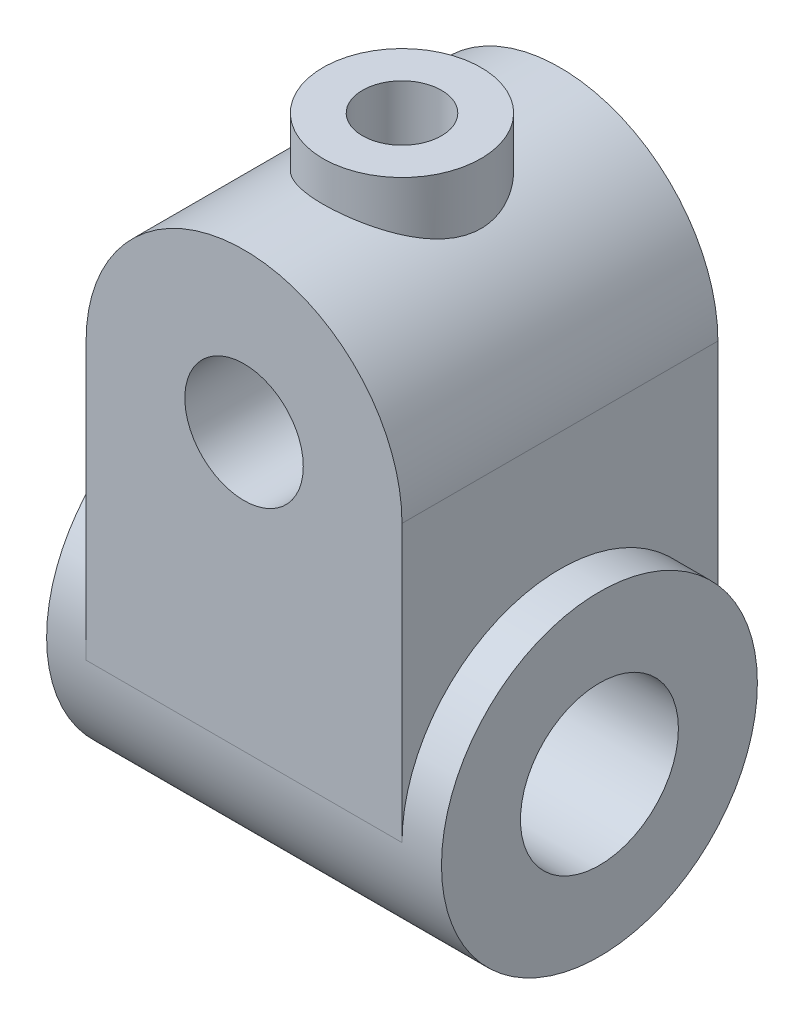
from build123d import *

# Parameters (mm, degrees)
SKETCH_1_R               = 15
EXTRUDE_1_DEPTH          = 40
EXTRUDE_2_DEPTH          = 10
EXTRUDE_2_DEPTH_BACK     = 90
SKETCH_2_R               = 40
SKETCH_3_R               = 20
CUT_EXTRUDE_1_DEPTH      = 154.948043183
EXTRUDE_3_REACH          = 189.883
EXTRUDE_3_END_RADIUS     = 40
SKETCH_4_R               = 20
CUT_EXTRUDE_2_REACH      = 189.883
CUT_EXTRUDE_2_END_RADIUS = 15
SKETCH_5_R               = 10


with BuildPart() as part:
    # Sketch 1 → Extrude 1 (new, symmetric)
    with BuildSketch(Plane.XY):
        with BuildLine():
            Line((0, 0), (80, 0))
            Line((80, 0), (80, 70))
            ThreePointArc((80, 70), (40, 110), (0, 70))
            Line((0, 70), (0, 0))
        make_face()
        with Locations((40, 70)):
            Circle(SKETCH_1_R, mode=Mode.SUBTRACT)
    extrude(amount=EXTRUDE_1_DEPTH, both=True)

    # Sketch 2 → Extrude 2 (add, two sides: drawn at the far end of the back side and taken through both)
    with BuildSketch(Plane(origin=(80, 0, 0), x_dir=(0, 0, -1), z_dir=(1, 0, 0)).offset(-EXTRUDE_2_DEPTH_BACK)):
        Circle(SKETCH_2_R)
    extrude(amount=EXTRUDE_2_DEPTH + EXTRUDE_2_DEPTH_BACK)

    # Sketch 3 → Cut-Extrude 1 (cut, through all)
    with BuildSketch(Plane(origin=(90, 0, 0), x_dir=(0, 0, -1), z_dir=(1, 0, 0))):
        Circle(SKETCH_3_R)
    extrude(amount=-CUT_EXTRUDE_1_DEPTH, mode=Mode.SUBTRACT)

    # Extrude 3: up to this cylinder (the profile starts outside it)
    extrude_3_end = Plane(origin=(40, 70, 0), z_dir=(0, 0, -1)) * Cylinder(EXTRUDE_3_END_RADIUS, 460.766, mode=Mode.PRIVATE)
    # Sketch 4 → Extrude 3 (add, up to the surface)
    with BuildSketch(Plane(origin=(0, 120, 0), x_dir=(-1, 0, 0), z_dir=(0, 1, 0)), mode=Mode.PRIVATE) as extrude_3_sk1:
        with Locations(Location((-40, 0, 0), (0, 0, 90))):
            Circle(SKETCH_4_R)
    extrude_3_tool1 = extrude(extrude_3_sk1.sketch, amount=-EXTRUDE_3_REACH, mode=Mode.PRIVATE) - extrude_3_end
    add(extrude_3_tool1.solids().sort_by_distance((40, 120, 0))[0])

    # Cut-Extrude 2: up to this cylinder (the profile starts outside it)
    cut_extrude_2_end = Plane(origin=(40, 70, 0), z_dir=(0, 0, -1)) * Cylinder(CUT_EXTRUDE_2_END_RADIUS, 410.766, mode=Mode.PRIVATE)
    # Sketch 5 → Cut-Extrude 2 (cut, up to the surface)
    with BuildSketch(Plane(origin=(0, 120, 0), x_dir=(1, 0, 0), z_dir=(0, 1, 0)), mode=Mode.PRIVATE) as cut_extrude_2_sk1:
        with Locations(Location((40, 0, 0), (0, 0, 270))):
            Circle(SKETCH_5_R)
    cut_extrude_2_tool1 = extrude(cut_extrude_2_sk1.sketch, amount=-CUT_EXTRUDE_2_REACH, mode=Mode.PRIVATE) - cut_extrude_2_end
    add(cut_extrude_2_tool1.solids().sort_by_distance((40, 120, 0))[0], mode=Mode.SUBTRACT)


solid = part.part
